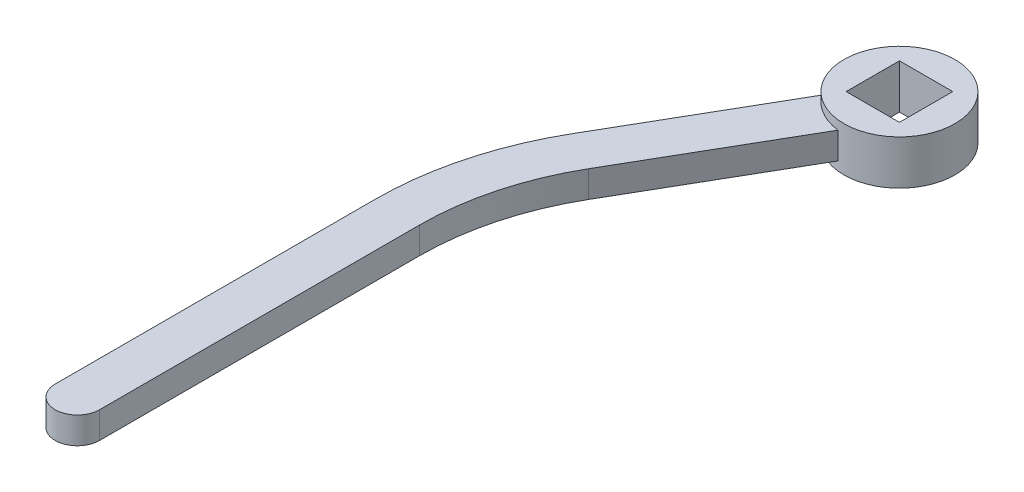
from build123d import *

# Parameters (mm, degrees)
HANDLE_DEPTH     = 3
SKETCH2_R        = 12.5
END_DEPTH        = 5
SKETCH4_W        = 12
SKETCH4_H        = 12
SQUARE_CUT_DEPTH = 170.595106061


with BuildPart() as part:
    # Sketch1 → handle (new, symmetric)
    with BuildSketch(Plane(origin=(0, 0, 0), x_dir=(1, 0, 0), z_dir=(0, 1, 0))):
        with BuildLine():
            Line((4.378221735, 106.961524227), (30.669872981, 152.5))
            Line((30.669872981, 152.5), (39.330127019, 147.5))
            Line((39.330127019, 147.5), (13.038475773, 101.961524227))
            ThreePointArc((13.038475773, 101.961524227), (7.044450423, 87.490666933), (5, 71.961524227))
            Line((5, 71.961524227), (5, 0))
            ThreePointArc((5, 0), (0, -5), (-5, 0))
            Line((-5, 0), (-5, 71.961524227))
            ThreePointArc((-5, 71.961524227), (-2.61480784, 90.078857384), (4.378221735, 106.961524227))
        make_face()
    extrude(amount=HANDLE_DEPTH, both=True)

    # Sketch2 → end (add, symmetric)
    with BuildSketch(Plane(origin=(0, 0, 0), x_dir=(1, 0, 0), z_dir=(0, 1, 0))):
        with Locations(Location((35, 150, 0), (0, 0, 270))):
            Circle(SKETCH2_R)
    extrude(amount=END_DEPTH, both=True)

    # Sketch4 → square-cut (cut, through all)
    with BuildSketch(Plane(origin=(0, 5, 0), x_dir=(-1, 0, 0), z_dir=(0, 1, 0))):
        with Locations((-35, -150)):
            Rectangle(SKETCH4_W, SKETCH4_H)
    extrude(amount=-SQUARE_CUT_DEPTH, mode=Mode.SUBTRACT)


solid = part.part
